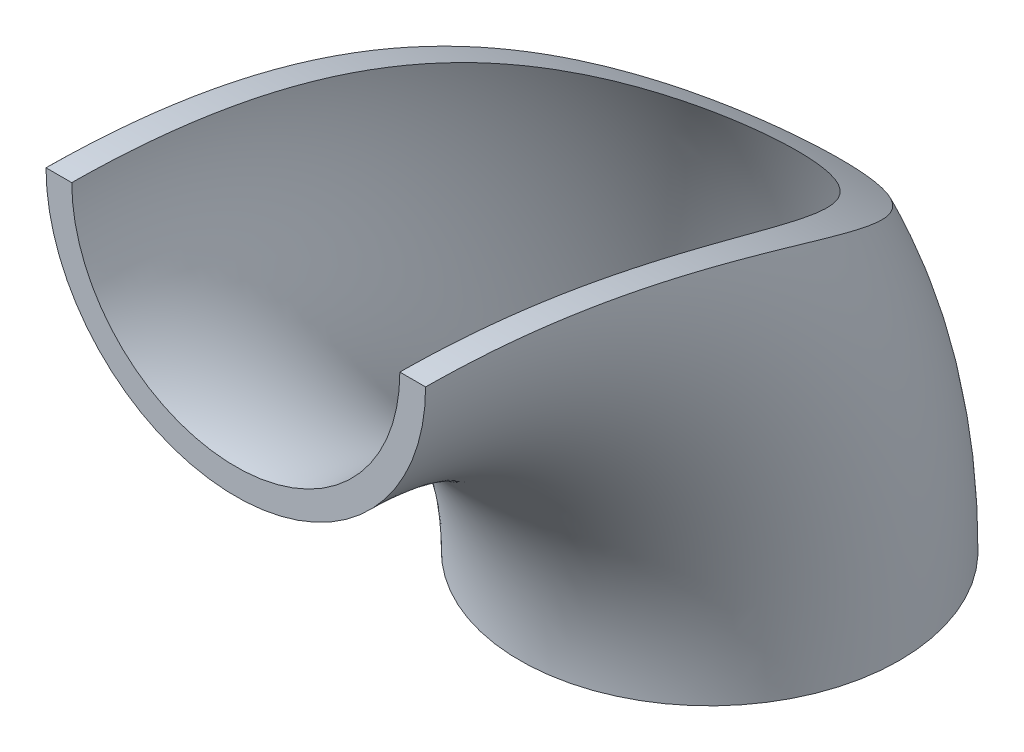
from build123d import *

# Parameters (mm, degrees)
ESQUISSE1_R             = 38.05
ESQUISSE1_R_2           = 32.89
ENL_V_MAT_EXTRU_1_DEPTH = 65


with BuildPart() as part:
    # Balayage2: sweep along a path in Esquisse2
    with BuildLine(Plane(origin=(0, 0, 0), x_dir=(0, 0, -1), z_dir=(1, 0, 0))) as balayage2_path:
        ThreePointArc((95, -95), (67.175144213, -27.824855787), (0, 0))
    # Esquisse1 → Balayage2 (sweep)
    with BuildSketch(Plane.XY):
        Circle(ESQUISSE1_R)
        Circle(ESQUISSE1_R_2, mode=Mode.SUBTRACT)
    sweep(path=balayage2_path.line)

    # Esquisse4 → Enl_v. mat.-Extru.1 (cut, symmetric)
    with BuildSketch(Plane.ZY):
        with BuildLine():
            Line((2.953699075, 0), (33.413898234, 56.755592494))
            Line((33.413898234, 56.755592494), (-140.861836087, 61.937355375))
            Line((-140.861836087, 61.937355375), (-126.514533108, -43.817624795))
            add(Edge.make_bspline(
                [(-126.514533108, -43.817624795), (-65.548320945, 0.483330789), (2.953699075, 0)],
                knots=[0, 0, 0, 1, 1, 1], degree=2))
        make_face()
    extrude(amount=ENL_V_MAT_EXTRU_1_DEPTH, both=True, mode=Mode.SUBTRACT)


solid = part.part
